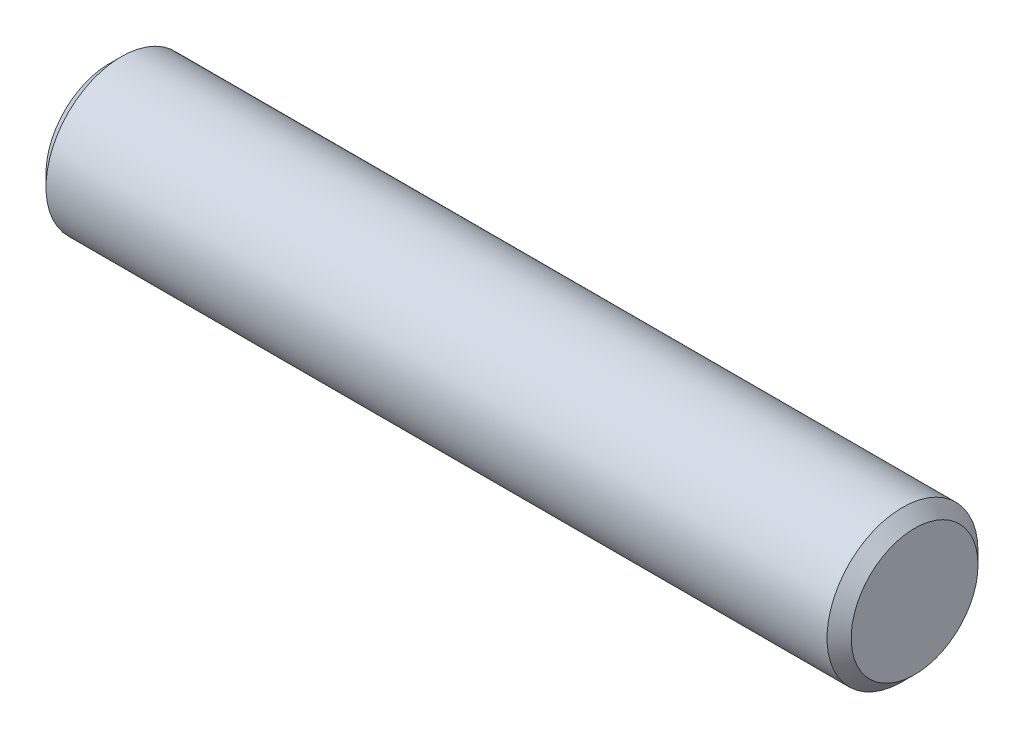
ISO-10303-21;
HEADER;
FILE_DESCRIPTION(('STEP AP214'),'2;1');
FILE_NAME('part.step','',(''),(''),'','','');
FILE_SCHEMA(('AUTOMOTIVE_DESIGN { 1 0 10303 214 1 1 1 1 }'));
ENDSEC;
DATA;
#1=APPLICATION_CONTEXT('core data for automotive mechanical design processes');
#2=APPLICATION_PROTOCOL_DEFINITION('international standard','automotive_design',2000,#1);
#3=PRODUCT_CONTEXT('',#1,'mechanical');
#4=PRODUCT('Part','Part','',(#3));
#5=PRODUCT_RELATED_PRODUCT_CATEGORY('part','',(#4));
#6=PRODUCT_DEFINITION_FORMATION('','',#4);
#7=PRODUCT_DEFINITION_CONTEXT('part definition',#1,'design');
#8=PRODUCT_DEFINITION('design','',#6,#7);
#9=PRODUCT_DEFINITION_SHAPE('','',#8);
#10=(LENGTH_UNIT() NAMED_UNIT(*) SI_UNIT(.MILLI.,.METRE.));
#11=(NAMED_UNIT(*) PLANE_ANGLE_UNIT() SI_UNIT($,.RADIAN.));
#12=(NAMED_UNIT(*) SI_UNIT($,.STERADIAN.) SOLID_ANGLE_UNIT());
#13=UNCERTAINTY_MEASURE_WITH_UNIT(LENGTH_MEASURE(1.E-05),#10,'distance_accuracy_value','');
#14=(GEOMETRIC_REPRESENTATION_CONTEXT(3) GLOBAL_UNCERTAINTY_ASSIGNED_CONTEXT((#13)) GLOBAL_UNIT_ASSIGNED_CONTEXT((#10,
#11,#12)) REPRESENTATION_CONTEXT('',''));
#15=CARTESIAN_POINT('',(0.,0.,0.));
#16=DIRECTION('',(0.,0.,1.));
#17=DIRECTION('',(1.,0.,0.));
#18=AXIS2_PLACEMENT_3D('',#15,#16,#17);
#19=CARTESIAN_POINT('',(25.4,0.,0.));
#20=DIRECTION('',(-1.,0.,0.));
#21=DIRECTION('',(0.,0.,1.));
#22=AXIS2_PLACEMENT_3D('',#19,#20,#21);
#23=CYLINDRICAL_SURFACE('',#22,2.38125);
#24=CARTESIAN_POINT('',(25.019,0.,0.));
#25=DIRECTION('',(1.,0.,0.));
#26=DIRECTION('',(0.,0.,-1.));
#27=AXIS2_PLACEMENT_3D('',#24,#25,#26);
#28=CIRCLE('',#27,2.38125);
#29=CARTESIAN_POINT('',(25.019,0.,-2.38125));
#30=VERTEX_POINT('',#29);
#31=EDGE_CURVE('E30',#30,#30,#28,.F.);
#32=ORIENTED_EDGE('',*,*,#31,.T.);
#33=EDGE_LOOP('',(#32));
#34=FACE_BOUND('',#33,.T.);
#35=CARTESIAN_POINT('',(0.381000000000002,0.,0.));
#36=DIRECTION('',(1.,0.,0.));
#37=DIRECTION('',(0.,0.,-1.));
#38=AXIS2_PLACEMENT_3D('',#35,#36,#37);
#39=CIRCLE('',#38,2.38125);
#40=CARTESIAN_POINT('',(0.381000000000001,0.,-2.38125));
#41=VERTEX_POINT('',#40);
#42=EDGE_CURVE('E34',#41,#41,#39,.T.);
#43=ORIENTED_EDGE('',*,*,#42,.T.);
#44=EDGE_LOOP('',(#43));
#45=FACE_BOUND('',#44,.T.);
#46=ADVANCED_FACE('F24',(#34,#45),#23,.T.);
#47=CARTESIAN_POINT('',(25.4,0.,0.));
#48=DIRECTION('',(1.,0.,0.));
#49=DIRECTION('',(0.,0.,-1.));
#50=AXIS2_PLACEMENT_3D('',#47,#48,#49);
#51=PLANE('',#50);
#52=CARTESIAN_POINT('',(25.4,0.,0.));
#53=DIRECTION('',(1.,0.,0.));
#54=DIRECTION('',(0.,0.,-1.));
#55=AXIS2_PLACEMENT_3D('',#52,#53,#54);
#56=CIRCLE('',#55,2.00025);
#57=CARTESIAN_POINT('',(25.4,0.,-2.00025));
#58=VERTEX_POINT('',#57);
#59=EDGE_CURVE('E38',#58,#58,#56,.T.);
#60=ORIENTED_EDGE('',*,*,#59,.T.);
#61=EDGE_LOOP('',(#60));
#62=FACE_BOUND('',#61,.T.);
#63=ADVANCED_FACE('F44',(#62),#51,.T.);
#64=CARTESIAN_POINT('',(0.,0.,0.));
#65=DIRECTION('',(1.,0.,0.));
#66=DIRECTION('',(0.,0.,-1.));
#67=AXIS2_PLACEMENT_3D('',#64,#65,#66);
#68=PLANE('',#67);
#69=CARTESIAN_POINT('',(0.,0.,0.));
#70=DIRECTION('',(1.,0.,0.));
#71=DIRECTION('',(0.,0.,-1.));
#72=AXIS2_PLACEMENT_3D('',#69,#70,#71);
#73=CIRCLE('',#72,2.00025);
#74=CARTESIAN_POINT('',(0.,0.,-2.00025));
#75=VERTEX_POINT('',#74);
#76=EDGE_CURVE('E10',#75,#75,#73,.F.);
#77=ORIENTED_EDGE('',*,*,#76,.T.);
#78=EDGE_LOOP('',(#77));
#79=FACE_BOUND('',#78,.T.);
#80=ADVANCED_FACE('F49',(#79),#68,.F.);
#81=CARTESIAN_POINT('',(25.4,0.,0.));
#82=DIRECTION('',(-1.,0.,0.));
#83=DIRECTION('',(0.,0.,1.));
#84=AXIS2_PLACEMENT_3D('',#81,#82,#83);
#85=CONICAL_SURFACE('',#84,2.00025,0.785398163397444);
#86=ORIENTED_EDGE('',*,*,#31,.F.);
#87=EDGE_LOOP('',(#86));
#88=FACE_BOUND('',#87,.T.);
#89=ORIENTED_EDGE('',*,*,#59,.F.);
#90=EDGE_LOOP('',(#89));
#91=FACE_BOUND('',#90,.T.);
#92=ADVANCED_FACE('F46',(#88,#91),#85,.T.);
#93=CARTESIAN_POINT('',(0.381000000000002,0.,0.));
#94=DIRECTION('',(1.,0.,0.));
#95=DIRECTION('',(0.,0.,-1.));
#96=AXIS2_PLACEMENT_3D('',#93,#94,#95);
#97=CONICAL_SURFACE('',#96,2.38125,0.78539816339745);
#98=CARTESIAN_POINT('',(0.,0.,-2.00025));
#99=CARTESIAN_POINT('',(0.00396874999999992,0.,-2.00421875));
#100=CARTESIAN_POINT('',(0.00793749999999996,0.,-2.0081875));
#101=CARTESIAN_POINT('',(0.015875,0.,-2.016125));
#102=CARTESIAN_POINT('',(0.0198437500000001,0.,-2.02009375));
#103=CARTESIAN_POINT('',(0.0277812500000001,0.,-2.02803125));
#104=CARTESIAN_POINT('',(0.0317500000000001,0.,-2.032));
#105=CARTESIAN_POINT('',(0.0396875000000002,0.,-2.0399375));
#106=CARTESIAN_POINT('',(0.0436562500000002,0.,-2.04390625));
#107=CARTESIAN_POINT('',(0.0515937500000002,0.,-2.05184375));
#108=CARTESIAN_POINT('',(0.0555625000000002,0.,-2.0558125));
#109=CARTESIAN_POINT('',(0.0635000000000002,0.,-2.06375));
#110=CARTESIAN_POINT('',(0.0674687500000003,0.,-2.06771875));
#111=CARTESIAN_POINT('',(0.0754062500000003,0.,-2.07565625));
#112=CARTESIAN_POINT('',(0.0793750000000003,0.,-2.079625));
#113=CARTESIAN_POINT('',(0.0873125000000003,0.,-2.0875625));
#114=CARTESIAN_POINT('',(0.0912812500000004,0.,-2.09153125));
#115=CARTESIAN_POINT('',(0.0992187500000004,0.,-2.09946875));
#116=CARTESIAN_POINT('',(0.1031875,0.,-2.1034375));
#117=CARTESIAN_POINT('',(0.111125,0.,-2.111375));
#118=CARTESIAN_POINT('',(0.11509375,0.,-2.11534375));
#119=CARTESIAN_POINT('',(0.123031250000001,0.,-2.12328125));
#120=CARTESIAN_POINT('',(0.127000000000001,0.,-2.12725));
#121=CARTESIAN_POINT('',(0.134937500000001,0.,-2.1351875));
#122=CARTESIAN_POINT('',(0.138906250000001,0.,-2.13915625));
#123=CARTESIAN_POINT('',(0.146843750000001,0.,-2.14709375));
#124=CARTESIAN_POINT('',(0.150812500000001,0.,-2.1510625));
#125=CARTESIAN_POINT('',(0.158750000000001,0.,-2.159));
#126=CARTESIAN_POINT('',(0.162718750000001,0.,-2.16296875));
#127=CARTESIAN_POINT('',(0.170656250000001,0.,-2.17090625));
#128=CARTESIAN_POINT('',(0.174625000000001,0.,-2.174875));
#129=CARTESIAN_POINT('',(0.182562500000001,0.,-2.1828125));
#130=CARTESIAN_POINT('',(0.186531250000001,0.,-2.18678125));
#131=CARTESIAN_POINT('',(0.194468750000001,0.,-2.19471875));
#132=CARTESIAN_POINT('',(0.198437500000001,0.,-2.1986875));
#133=CARTESIAN_POINT('',(0.206375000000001,0.,-2.206625));
#134=CARTESIAN_POINT('',(0.210343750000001,0.,-2.21059375));
#135=CARTESIAN_POINT('',(0.218281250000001,0.,-2.21853125));
#136=CARTESIAN_POINT('',(0.222250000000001,0.,-2.2225));
#137=CARTESIAN_POINT('',(0.230187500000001,0.,-2.2304375));
#138=CARTESIAN_POINT('',(0.234156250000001,0.,-2.23440625));
#139=CARTESIAN_POINT('',(0.242093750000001,0.,-2.24234375));
#140=CARTESIAN_POINT('',(0.246062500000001,0.,-2.2463125));
#141=CARTESIAN_POINT('',(0.254000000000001,0.,-2.25425));
#142=CARTESIAN_POINT('',(0.257968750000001,0.,-2.25821875));
#143=CARTESIAN_POINT('',(0.265906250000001,0.,-2.26615625));
#144=CARTESIAN_POINT('',(0.269875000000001,0.,-2.270125));
#145=CARTESIAN_POINT('',(0.277812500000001,0.,-2.2780625));
#146=CARTESIAN_POINT('',(0.281781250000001,0.,-2.28203125));
#147=CARTESIAN_POINT('',(0.289718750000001,0.,-2.28996875));
#148=CARTESIAN_POINT('',(0.293687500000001,0.,-2.2939375));
#149=CARTESIAN_POINT('',(0.301625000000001,0.,-2.301875));
#150=CARTESIAN_POINT('',(0.305593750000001,0.,-2.30584375));
#151=CARTESIAN_POINT('',(0.313531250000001,0.,-2.31378125));
#152=CARTESIAN_POINT('',(0.317500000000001,0.,-2.31775));
#153=CARTESIAN_POINT('',(0.325437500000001,0.,-2.3256875));
#154=CARTESIAN_POINT('',(0.329406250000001,0.,-2.32965625));
#155=CARTESIAN_POINT('',(0.337343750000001,0.,-2.33759375));
#156=CARTESIAN_POINT('',(0.341312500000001,0.,-2.3415625));
#157=CARTESIAN_POINT('',(0.349250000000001,0.,-2.3495));
#158=CARTESIAN_POINT('',(0.353218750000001,0.,-2.35346875));
#159=CARTESIAN_POINT('',(0.361156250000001,0.,-2.36140625));
#160=CARTESIAN_POINT('',(0.365125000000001,0.,-2.365375));
#161=CARTESIAN_POINT('',(0.373062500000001,0.,-2.3733125));
#162=CARTESIAN_POINT('',(0.377031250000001,0.,-2.37728125));
#163=CARTESIAN_POINT('',(0.381000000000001,0.,-2.38125));
#164=B_SPLINE_CURVE_WITH_KNOTS('',3,(#98,#99,#100,#101,#102,#103,#104,#105,#106,#107,#108,#109,
#110,#111,#112,#113,#114,#115,#116,#117,#118,#119,#120,#121,#122,#123,#124,#125,#126,#127,#128,
#129,#130,#131,#132,#133,#134,#135,#136,#137,#138,#139,#140,#141,#142,#143,#144,#145,#146,#147,
#148,#149,#150,#151,#152,#153,#154,#155,#156,#157,#158,#159,#160,#161,#162,#163),.UNSPECIFIED.,
.F.,.F.,(4,2,2,2,2,2,2,2,2,2,2,2,2,2,2,2,2,2,2,2,2,2,2,2,2,2,2,2,2,2,2,2,4),(0.,
0.0168379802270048,0.0336759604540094,0.0505139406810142,0.067351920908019,0.0841899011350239,
0.101027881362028,0.117865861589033,0.134703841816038,0.151541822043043,0.168379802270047,
0.185217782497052,0.202055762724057,0.218893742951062,0.235731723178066,0.252569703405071,
0.269407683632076,0.286245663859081,0.303083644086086,0.31992162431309,0.336759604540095,
0.3535975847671,0.370435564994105,0.387273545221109,0.404111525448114,0.420949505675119,
0.437787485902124,0.454625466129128,0.471463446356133,0.488301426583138,0.505139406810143,
0.521977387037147,0.538815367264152),.UNSPECIFIED.);
#165=EDGE_CURVE('BSEAM48',#75,#41,#164,.T.);
#166=ORIENTED_EDGE('',*,*,#76,.F.);
#167=ORIENTED_EDGE('',*,*,#42,.F.);
#168=ORIENTED_EDGE('',*,*,#165,.T.);
#169=ORIENTED_EDGE('',*,*,#165,.F.);
#170=EDGE_LOOP('',(#166,#168,#167,#169));
#171=FACE_BOUND('',#170,.T.);
#172=ADVANCED_FACE('F48',(#171),#97,.T.);
#173=CLOSED_SHELL('',(#46,#63,#80,#92,#172));
#174=MANIFOLD_SOLID_BREP('B2',#173);
#175=ADVANCED_BREP_SHAPE_REPRESENTATION('',(#18,#174),#14);
#176=SHAPE_DEFINITION_REPRESENTATION(#9,#175);
ENDSEC;
END-ISO-10303-21;
